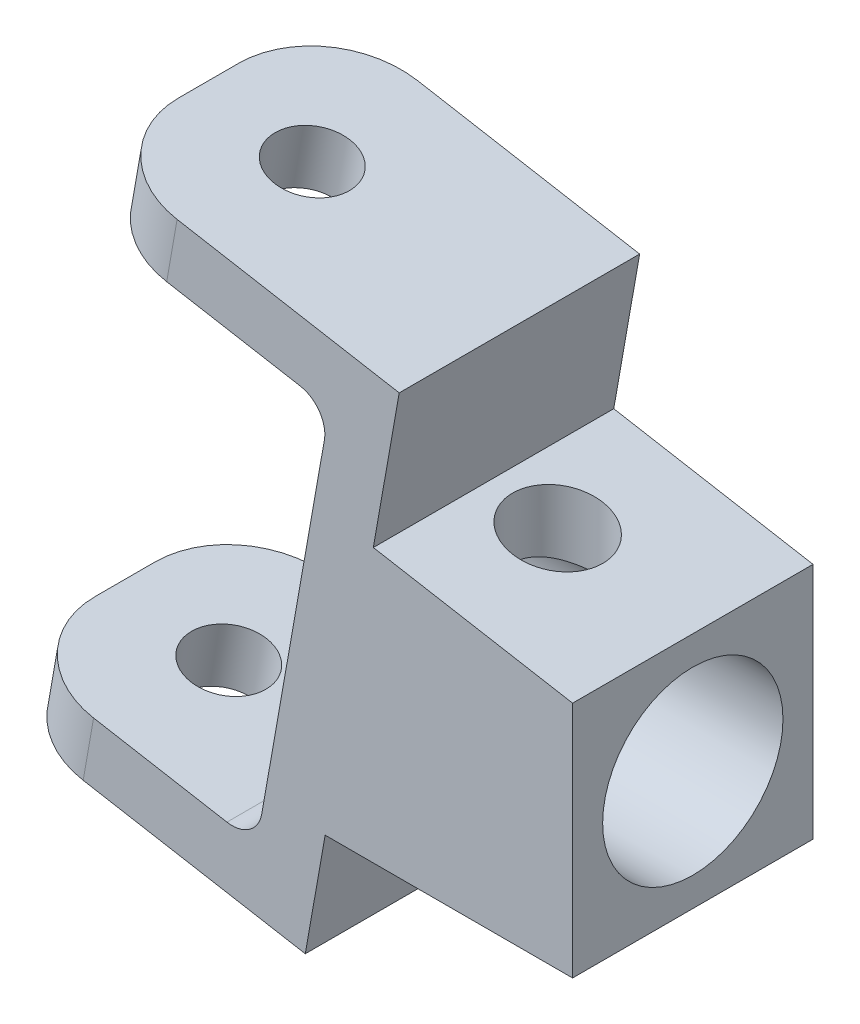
from build123d import *

# Parameters (mm, degrees)
BOSS_EXTRUDE1_DEPTH = 12.7
SKETCH3_R           = 9.525
CUT_EXTRUDE1_DEPTH  = 23.495
SKETCH7_R           = 3.9878
CUT_EXTRUDE4_DEPTH  = 67.31
FILLET1_R           = 9.525
FILLET3_R           = 3.175
SKETCH9_R           = 4.7625
CUT_EXTRUDE5_DEPTH  = 25.4
SKETCH10_R          = 3.175
CUT_EXTRUDE6_DEPTH  = 22.86


with BuildPart() as part:
    # Sketch2 → Boss-Extrude1 (new, symmetric)
    with BuildSketch(Plane.XY):
        Polygon((-43.607503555, -18.686102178), (-10.763968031, -24.477303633), (-8.664918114, -12.573), (17.4752, -12.573), (17.4752, 12.573), (-3.576477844, 16.284978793), (-0.839974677, 31.804459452), (-33.683510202, 37.595660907), (-34.78617613, 31.342131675), (-8.196169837, 26.653596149), (-15.914831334, -17.121108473), (-42.504837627, -12.432572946), align=None)
    extrude(amount=BOSS_EXTRUDE1_DEPTH, both=True)

    # Sketch3 → Cut-Extrude1 (cut, symmetric)
    with BuildSketch(Plane(origin=(0, 0, 0), x_dir=(0, 0, -1), z_dir=(1, 0, 0))):
        with Locations(Location((0, 0, 0), (0, 0, 90))):
            Circle(SKETCH3_R)
    extrude(amount=CUT_EXTRUDE1_DEPTH, both=True, mode=Mode.SUBTRACT)

    # Sketch7 → Cut-Extrude4 (cut)
    with BuildSketch(Plane(origin=(5.413554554, 30.701793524, 0), x_dir=(0.9848077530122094, -0.17364817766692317, 0), z_dir=(0.17364817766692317, 0.9848077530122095, 0))):
        with Locations(Location((-28.575, 0, 0), (0, 0, 180))):
            Circle(SKETCH7_R)
    extrude(amount=-CUT_EXTRUDE4_DEPTH, mode=Mode.SUBTRACT)

    # Fillet1
    fillet1_edges = [part.edges().sort_by_distance(p)[0] for p in [
        (-34.234843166, 34.468896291, -12.7),
        (-43.056170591, -15.559337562, -12.7),
        (-34.234843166, 34.468896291, 12.7),
        (-43.056170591, -15.559337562, 12.7),
    ]]
    fillet(fillet1_edges, radius=FILLET1_R)

    # Fillet3
    fillet3_edges = [part.edges().sort_by_distance(p)[0] for p in [
        (-15.914831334, -17.121108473, 0),
        (-8.196169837, 26.653596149, 0),
    ]]
    fillet(fillet3_edges, radius=FILLET3_R)

    # Sketch9 → Cut-Extrude5 (cut)
    with BuildSketch(Plane(origin=(0, 0, 0), x_dir=(1, 0, 0), z_dir=(0, 1, 0))):
        with Locations(Location((3.2004, 0, 0), (0, 0, 90))):
            Circle(SKETCH9_R)
    extrude(amount=CUT_EXTRUDE5_DEPTH, mode=Mode.SUBTRACT)

    # Sketch10 → Cut-Extrude6 (cut)
    with BuildSketch(Plane(origin=(0, 0, 0), x_dir=(1, 0, 0), z_dir=(0, 1, 0))):
        with Locations(Location((3.2004, 0, 0), (0, 0, 270))):
            Circle(SKETCH10_R)
    extrude(amount=-CUT_EXTRUDE6_DEPTH, mode=Mode.SUBTRACT)


solid = part.part
